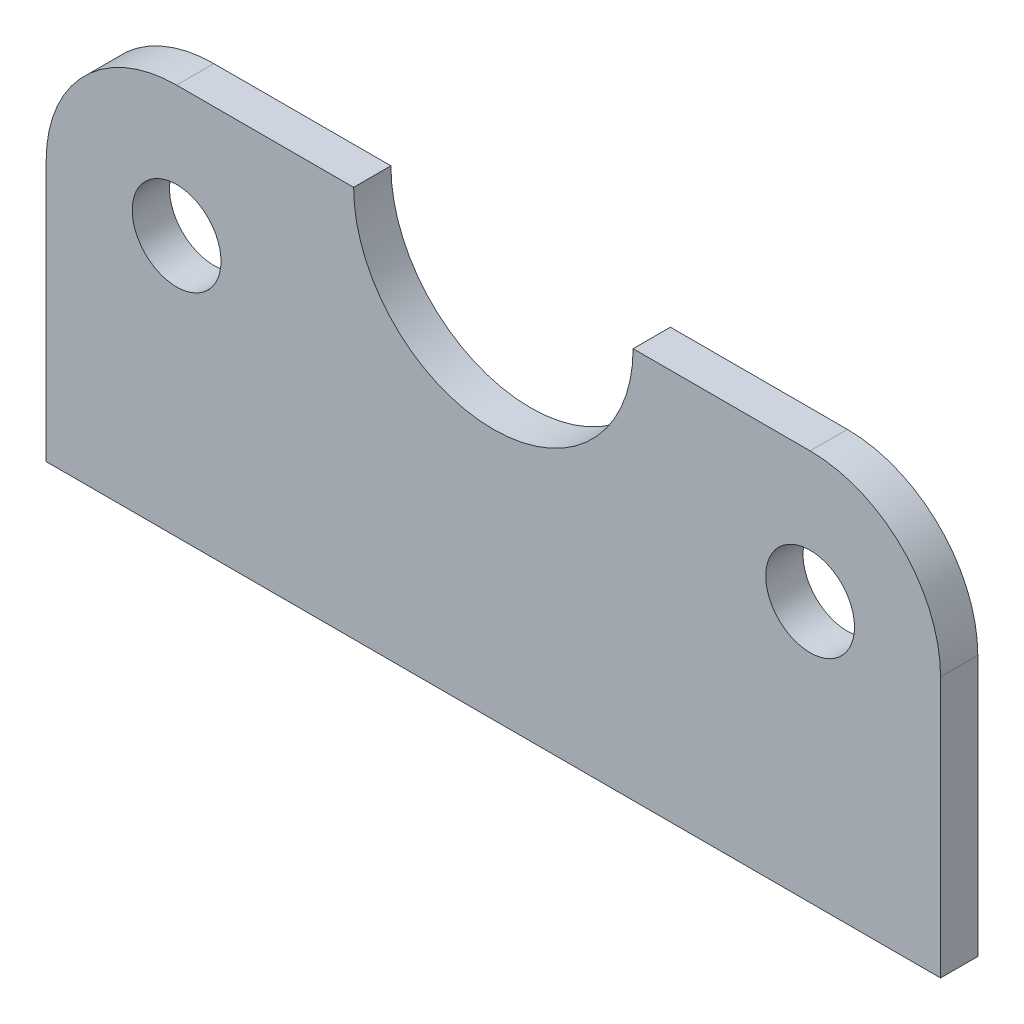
ISO-10303-21;
HEADER;
FILE_DESCRIPTION(('STEP AP214'),'2;1');
FILE_NAME('part.step','',(''),(''),'','','');
FILE_SCHEMA(('AUTOMOTIVE_DESIGN { 1 0 10303 214 1 1 1 1 }'));
ENDSEC;
DATA;
#1=APPLICATION_CONTEXT('core data for automotive mechanical design processes');
#2=APPLICATION_PROTOCOL_DEFINITION('international standard','automotive_design',2000,#1);
#3=PRODUCT_CONTEXT('',#1,'mechanical');
#4=PRODUCT('Part','Part','',(#3));
#5=PRODUCT_RELATED_PRODUCT_CATEGORY('part','',(#4));
#6=PRODUCT_DEFINITION_FORMATION('','',#4);
#7=PRODUCT_DEFINITION_CONTEXT('part definition',#1,'design');
#8=PRODUCT_DEFINITION('design','',#6,#7);
#9=PRODUCT_DEFINITION_SHAPE('','',#8);
#10=(LENGTH_UNIT() NAMED_UNIT(*) SI_UNIT(.MILLI.,.METRE.));
#11=(NAMED_UNIT(*) PLANE_ANGLE_UNIT() SI_UNIT($,.RADIAN.));
#12=(NAMED_UNIT(*) SI_UNIT($,.STERADIAN.) SOLID_ANGLE_UNIT());
#13=UNCERTAINTY_MEASURE_WITH_UNIT(LENGTH_MEASURE(1.E-05),#10,'distance_accuracy_value','');
#14=(GEOMETRIC_REPRESENTATION_CONTEXT(3) GLOBAL_UNCERTAINTY_ASSIGNED_CONTEXT((#13)) GLOBAL_UNIT_ASSIGNED_CONTEXT((#10,
#11,#12)) REPRESENTATION_CONTEXT('',''));
#15=CARTESIAN_POINT('',(0.,0.,0.));
#16=DIRECTION('',(0.,0.,1.));
#17=DIRECTION('',(1.,0.,0.));
#18=AXIS2_PLACEMENT_3D('',#15,#16,#17);
#19=CARTESIAN_POINT('',(-101.6,0.,-4.23333333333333));
#20=DIRECTION('',(0.,-1.,0.));
#21=DIRECTION('',(0.,0.,-1.));
#22=AXIS2_PLACEMENT_3D('',#19,#20,#21);
#23=PLANE('',#22);
#24=DIRECTION('',(1.,0.,0.));
#25=VECTOR('',#24,1.);
#26=CARTESIAN_POINT('',(-101.6,0.,0.));
#27=LINE('',#26,#25);
#28=CARTESIAN_POINT('',(-101.6,0.,0.));
#29=VERTEX_POINT('',#28);
#30=CARTESIAN_POINT('',(0.,0.,0.));
#31=VERTEX_POINT('',#30);
#32=EDGE_CURVE('E129',#29,#31,#27,.T.);
#33=ORIENTED_EDGE('',*,*,#32,.F.);
#34=DIRECTION('',(0.,0.,1.));
#35=VECTOR('',#34,1.);
#36=CARTESIAN_POINT('',(-101.6,0.,-4.23333333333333));
#37=LINE('',#36,#35);
#38=CARTESIAN_POINT('',(-101.6,0.,-4.23333333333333));
#39=VERTEX_POINT('',#38);
#40=EDGE_CURVE('E11',#39,#29,#37,.T.);
#41=ORIENTED_EDGE('',*,*,#40,.F.);
#42=DIRECTION('',(1.,0.,0.));
#43=VECTOR('',#42,1.);
#44=CARTESIAN_POINT('',(-101.6,0.,-4.23333333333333));
#45=LINE('',#44,#43);
#46=CARTESIAN_POINT('',(0.,0.,-4.23333333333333));
#47=VERTEX_POINT('',#46);
#48=EDGE_CURVE('E150',#39,#47,#45,.T.);
#49=ORIENTED_EDGE('',*,*,#48,.T.);
#50=DIRECTION('',(0.,0.,1.));
#51=VECTOR('',#50,1.);
#52=CARTESIAN_POINT('',(0.,0.,-4.23333333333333));
#53=LINE('',#52,#51);
#54=EDGE_CURVE('E35',#47,#31,#53,.T.);
#55=ORIENTED_EDGE('',*,*,#54,.T.);
#56=EDGE_LOOP('',(#33,#41,#49,#55));
#57=FACE_BOUND('',#56,.T.);
#58=ADVANCED_FACE('F32',(#57),#23,.T.);
#59=CARTESIAN_POINT('',(-101.6,29.6333333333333,-4.23333333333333));
#60=DIRECTION('',(-1.,0.,0.));
#61=DIRECTION('',(0.,0.,1.));
#62=AXIS2_PLACEMENT_3D('',#59,#60,#61);
#63=PLANE('',#62);
#64=DIRECTION('',(0.,-1.,0.));
#65=VECTOR('',#64,1.);
#66=CARTESIAN_POINT('',(-101.6,29.6333333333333,0.));
#67=LINE('',#66,#65);
#68=CARTESIAN_POINT('',(-101.6,29.6333333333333,0.));
#69=VERTEX_POINT('',#68);
#70=EDGE_CURVE('E148',#69,#29,#67,.T.);
#71=ORIENTED_EDGE('',*,*,#70,.F.);
#72=DIRECTION('',(0.,0.,1.));
#73=VECTOR('',#72,1.);
#74=CARTESIAN_POINT('',(-101.6,29.6333333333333,-4.23333333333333));
#75=LINE('',#74,#73);
#76=CARTESIAN_POINT('',(-101.6,29.6333333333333,-4.23333333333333));
#77=VERTEX_POINT('',#76);
#78=EDGE_CURVE('E41',#77,#69,#75,.T.);
#79=ORIENTED_EDGE('',*,*,#78,.F.);
#80=DIRECTION('',(0.,-1.,0.));
#81=VECTOR('',#80,1.);
#82=CARTESIAN_POINT('',(-101.6,29.6333333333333,-4.23333333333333));
#83=LINE('',#82,#81);
#84=EDGE_CURVE('E119',#77,#39,#83,.T.);
#85=ORIENTED_EDGE('',*,*,#84,.T.);
#86=ORIENTED_EDGE('',*,*,#40,.T.);
#87=EDGE_LOOP('',(#71,#79,#85,#86));
#88=FACE_BOUND('',#87,.T.);
#89=ADVANCED_FACE('F162',(#88),#63,.T.);
#90=CARTESIAN_POINT('',(-86.7833333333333,29.6333333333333,-4.23333333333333));
#91=DIRECTION('',(0.,0.,1.));
#92=DIRECTION('',(1.,0.,0.));
#93=AXIS2_PLACEMENT_3D('',#90,#91,#92);
#94=CYLINDRICAL_SURFACE('',#93,14.8166666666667);
#95=CARTESIAN_POINT('',(-86.7833333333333,29.6333333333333,0.));
#96=DIRECTION('',(0.,0.,1.));
#97=DIRECTION('',(1.,0.,0.));
#98=AXIS2_PLACEMENT_3D('',#95,#96,#97);
#99=CIRCLE('',#98,14.8166666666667);
#100=CARTESIAN_POINT('',(-86.7833333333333,44.45,0.));
#101=VERTEX_POINT('',#100);
#102=EDGE_CURVE('E106',#101,#69,#99,.T.);
#103=ORIENTED_EDGE('',*,*,#102,.F.);
#104=DIRECTION('',(0.,0.,1.));
#105=VECTOR('',#104,1.);
#106=CARTESIAN_POINT('',(-86.7833333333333,44.45,-4.23333333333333));
#107=LINE('',#106,#105);
#108=CARTESIAN_POINT('',(-86.7833333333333,44.45,-4.23333333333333));
#109=VERTEX_POINT('',#108);
#110=EDGE_CURVE('E101',#109,#101,#107,.T.);
#111=ORIENTED_EDGE('',*,*,#110,.F.);
#112=CARTESIAN_POINT('',(-86.7833333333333,29.6333333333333,-4.23333333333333));
#113=DIRECTION('',(0.,0.,1.));
#114=DIRECTION('',(1.,0.,0.));
#115=AXIS2_PLACEMENT_3D('',#112,#113,#114);
#116=CIRCLE('',#115,14.8166666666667);
#117=EDGE_CURVE('E104',#109,#77,#116,.T.);
#118=ORIENTED_EDGE('',*,*,#117,.T.);
#119=ORIENTED_EDGE('',*,*,#78,.T.);
#120=EDGE_LOOP('',(#103,#111,#118,#119));
#121=FACE_BOUND('',#120,.T.);
#122=ADVANCED_FACE('F103',(#121),#94,.T.);
#123=CARTESIAN_POINT('',(-66.675,44.45,-4.23333333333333));
#124=DIRECTION('',(0.,1.,0.));
#125=DIRECTION('',(0.,0.,1.));
#126=AXIS2_PLACEMENT_3D('',#123,#124,#125);
#127=PLANE('',#126);
#128=DIRECTION('',(-1.,0.,0.));
#129=VECTOR('',#128,1.);
#130=CARTESIAN_POINT('',(-66.675,44.45,0.));
#131=LINE('',#130,#129);
#132=CARTESIAN_POINT('',(-66.675,44.45,0.));
#133=VERTEX_POINT('',#132);
#134=EDGE_CURVE('E145',#133,#101,#131,.T.);
#135=ORIENTED_EDGE('',*,*,#134,.F.);
#136=DIRECTION('',(0.,0.,1.));
#137=VECTOR('',#136,1.);
#138=CARTESIAN_POINT('',(-66.675,44.45,-4.23333333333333));
#139=LINE('',#138,#137);
#140=CARTESIAN_POINT('',(-66.675,44.45,-4.23333333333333));
#141=VERTEX_POINT('',#140);
#142=EDGE_CURVE('E111',#141,#133,#139,.T.);
#143=ORIENTED_EDGE('',*,*,#142,.F.);
#144=DIRECTION('',(-1.,0.,0.));
#145=VECTOR('',#144,1.);
#146=CARTESIAN_POINT('',(-66.675,44.45,-4.23333333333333));
#147=LINE('',#146,#145);
#148=EDGE_CURVE('E117',#141,#109,#147,.T.);
#149=ORIENTED_EDGE('',*,*,#148,.T.);
#150=ORIENTED_EDGE('',*,*,#110,.T.);
#151=EDGE_LOOP('',(#135,#143,#149,#150));
#152=FACE_BOUND('',#151,.T.);
#153=ADVANCED_FACE('F121',(#152),#127,.T.);
#154=CARTESIAN_POINT('',(-50.8,44.45,-4.23333333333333));
#155=DIRECTION('',(0.,0.,1.));
#156=DIRECTION('',(1.,0.,0.));
#157=AXIS2_PLACEMENT_3D('',#154,#155,#156);
#158=CYLINDRICAL_SURFACE('',#157,15.875);
#159=CARTESIAN_POINT('',(-50.8,44.45,0.));
#160=DIRECTION('',(0.,0.,-1.));
#161=DIRECTION('',(1.,0.,0.));
#162=AXIS2_PLACEMENT_3D('',#159,#160,#161);
#163=CIRCLE('',#162,15.875);
#164=CARTESIAN_POINT('',(-34.925,44.45,0.));
#165=VERTEX_POINT('',#164);
#166=EDGE_CURVE('E142',#165,#133,#163,.T.);
#167=ORIENTED_EDGE('',*,*,#166,.F.);
#168=DIRECTION('',(0.,0.,1.));
#169=VECTOR('',#168,1.);
#170=CARTESIAN_POINT('',(-34.925,44.45,-4.23333333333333));
#171=LINE('',#170,#169);
#172=CARTESIAN_POINT('',(-34.925,44.45,-4.23333333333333));
#173=VERTEX_POINT('',#172);
#174=EDGE_CURVE('E154',#173,#165,#171,.T.);
#175=ORIENTED_EDGE('',*,*,#174,.F.);
#176=CARTESIAN_POINT('',(-50.8,44.45,-4.23333333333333));
#177=DIRECTION('',(0.,0.,-1.));
#178=DIRECTION('',(1.,0.,0.));
#179=AXIS2_PLACEMENT_3D('',#176,#177,#178);
#180=CIRCLE('',#179,15.875);
#181=EDGE_CURVE('E122',#173,#141,#180,.T.);
#182=ORIENTED_EDGE('',*,*,#181,.T.);
#183=ORIENTED_EDGE('',*,*,#142,.T.);
#184=EDGE_LOOP('',(#167,#175,#182,#183));
#185=FACE_BOUND('',#184,.T.);
#186=ADVANCED_FACE('F175',(#185),#158,.F.);
#187=CARTESIAN_POINT('',(-14.8166666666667,44.45,-4.23333333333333));
#188=DIRECTION('',(0.,1.,0.));
#189=DIRECTION('',(0.,0.,1.));
#190=AXIS2_PLACEMENT_3D('',#187,#188,#189);
#191=PLANE('',#190);
#192=DIRECTION('',(-1.,0.,0.));
#193=VECTOR('',#192,1.);
#194=CARTESIAN_POINT('',(-14.8166666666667,44.45,0.));
#195=LINE('',#194,#193);
#196=CARTESIAN_POINT('',(-14.8166666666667,44.45,0.));
#197=VERTEX_POINT('',#196);
#198=EDGE_CURVE('E139',#197,#165,#195,.T.);
#199=ORIENTED_EDGE('',*,*,#198,.F.);
#200=DIRECTION('',(0.,0.,1.));
#201=VECTOR('',#200,1.);
#202=CARTESIAN_POINT('',(-14.8166666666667,44.45,-4.23333333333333));
#203=LINE('',#202,#201);
#204=CARTESIAN_POINT('',(-14.8166666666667,44.45,-4.23333333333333));
#205=VERTEX_POINT('',#204);
#206=EDGE_CURVE('E156',#205,#197,#203,.T.);
#207=ORIENTED_EDGE('',*,*,#206,.F.);
#208=DIRECTION('',(-1.,0.,0.));
#209=VECTOR('',#208,1.);
#210=CARTESIAN_POINT('',(-14.8166666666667,44.45,-4.23333333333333));
#211=LINE('',#210,#209);
#212=EDGE_CURVE('E124',#205,#173,#211,.T.);
#213=ORIENTED_EDGE('',*,*,#212,.T.);
#214=ORIENTED_EDGE('',*,*,#174,.T.);
#215=EDGE_LOOP('',(#199,#207,#213,#214));
#216=FACE_BOUND('',#215,.T.);
#217=ADVANCED_FACE('F178',(#216),#191,.T.);
#218=CARTESIAN_POINT('',(-14.8166666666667,29.6333333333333,-4.23333333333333));
#219=DIRECTION('',(0.,0.,1.));
#220=DIRECTION('',(1.,0.,0.));
#221=AXIS2_PLACEMENT_3D('',#218,#219,#220);
#222=CYLINDRICAL_SURFACE('',#221,14.8166666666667);
#223=CARTESIAN_POINT('',(-14.8166666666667,29.6333333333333,0.));
#224=DIRECTION('',(0.,0.,1.));
#225=DIRECTION('',(1.,0.,0.));
#226=AXIS2_PLACEMENT_3D('',#223,#224,#225);
#227=CIRCLE('',#226,14.8166666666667);
#228=CARTESIAN_POINT('',(0.,29.6333333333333,0.));
#229=VERTEX_POINT('',#228);
#230=EDGE_CURVE('E136',#229,#197,#227,.T.);
#231=ORIENTED_EDGE('',*,*,#230,.F.);
#232=DIRECTION('',(0.,0.,1.));
#233=VECTOR('',#232,1.);
#234=CARTESIAN_POINT('',(0.,29.6333333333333,-4.23333333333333));
#235=LINE('',#234,#233);
#236=CARTESIAN_POINT('',(0.,29.6333333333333,-4.23333333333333));
#237=VERTEX_POINT('',#236);
#238=EDGE_CURVE('E157',#237,#229,#235,.T.);
#239=ORIENTED_EDGE('',*,*,#238,.F.);
#240=CARTESIAN_POINT('',(-14.8166666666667,29.6333333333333,-4.23333333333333));
#241=DIRECTION('',(0.,0.,1.));
#242=DIRECTION('',(1.,0.,0.));
#243=AXIS2_PLACEMENT_3D('',#240,#241,#242);
#244=CIRCLE('',#243,14.8166666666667);
#245=EDGE_CURVE('E224',#237,#205,#244,.T.);
#246=ORIENTED_EDGE('',*,*,#245,.T.);
#247=ORIENTED_EDGE('',*,*,#206,.T.);
#248=EDGE_LOOP('',(#231,#239,#246,#247));
#249=FACE_BOUND('',#248,.T.);
#250=ADVANCED_FACE('F182',(#249),#222,.T.);
#251=CARTESIAN_POINT('',(0.,0.,-4.23333333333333));
#252=DIRECTION('',(1.,0.,0.));
#253=DIRECTION('',(0.,0.,-1.));
#254=AXIS2_PLACEMENT_3D('',#251,#252,#253);
#255=PLANE('',#254);
#256=DIRECTION('',(0.,1.,0.));
#257=VECTOR('',#256,1.);
#258=CARTESIAN_POINT('',(0.,0.,0.));
#259=LINE('',#258,#257);
#260=EDGE_CURVE('E132',#31,#229,#259,.T.);
#261=ORIENTED_EDGE('',*,*,#260,.F.);
#262=ORIENTED_EDGE('',*,*,#54,.F.);
#263=DIRECTION('',(0.,1.,0.));
#264=VECTOR('',#263,1.);
#265=CARTESIAN_POINT('',(0.,0.,-4.23333333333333));
#266=LINE('',#265,#264);
#267=EDGE_CURVE('E222',#47,#237,#266,.T.);
#268=ORIENTED_EDGE('',*,*,#267,.T.);
#269=ORIENTED_EDGE('',*,*,#238,.T.);
#270=EDGE_LOOP('',(#261,#262,#268,#269));
#271=FACE_BOUND('',#270,.T.);
#272=ADVANCED_FACE('F159',(#271),#255,.T.);
#273=CARTESIAN_POINT('',(-14.8166666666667,29.6333333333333,-4.23333333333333));
#274=DIRECTION('',(0.,0.,1.));
#275=DIRECTION('',(1.,0.,0.));
#276=AXIS2_PLACEMENT_3D('',#273,#274,#275);
#277=PLANE('',#276);
#278=CARTESIAN_POINT('',(-86.7833333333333,29.6333333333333,-4.23333333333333));
#279=DIRECTION('',(0.,0.,1.));
#280=DIRECTION('',(1.,0.,0.));
#281=AXIS2_PLACEMENT_3D('',#278,#279,#280);
#282=CIRCLE('',#281,5.04189999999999);
#283=CARTESIAN_POINT('',(-81.7414333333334,29.6333333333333,-4.23333333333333));
#284=VERTEX_POINT('',#283);
#285=EDGE_CURVE('E212',#284,#284,#282,.T.);
#286=ORIENTED_EDGE('',*,*,#285,.T.);
#287=EDGE_LOOP('',(#286));
#288=FACE_BOUND('',#287,.T.);
#289=CARTESIAN_POINT('',(-14.8166666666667,29.6333333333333,-4.23333333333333));
#290=DIRECTION('',(0.,0.,1.));
#291=DIRECTION('',(1.,0.,0.));
#292=AXIS2_PLACEMENT_3D('',#289,#290,#291);
#293=CIRCLE('',#292,5.04189999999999);
#294=CARTESIAN_POINT('',(-9.77476666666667,29.6333333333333,-4.23333333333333));
#295=VERTEX_POINT('',#294);
#296=EDGE_CURVE('E133',#295,#295,#293,.T.);
#297=ORIENTED_EDGE('',*,*,#296,.T.);
#298=EDGE_LOOP('',(#297));
#299=FACE_BOUND('',#298,.T.);
#300=ORIENTED_EDGE('',*,*,#48,.F.);
#301=ORIENTED_EDGE('',*,*,#84,.F.);
#302=ORIENTED_EDGE('',*,*,#117,.F.);
#303=ORIENTED_EDGE('',*,*,#148,.F.);
#304=ORIENTED_EDGE('',*,*,#181,.F.);
#305=ORIENTED_EDGE('',*,*,#212,.F.);
#306=ORIENTED_EDGE('',*,*,#245,.F.);
#307=ORIENTED_EDGE('',*,*,#267,.F.);
#308=EDGE_LOOP('',(#300,#301,#302,#303,#304,#305,#306,#307));
#309=FACE_BOUND('',#308,.T.);
#310=ADVANCED_FACE('F115',(#288,#299,#309),#277,.F.);
#311=CARTESIAN_POINT('',(-14.8166666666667,29.6333333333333,0.));
#312=DIRECTION('',(0.,0.,1.));
#313=DIRECTION('',(1.,0.,0.));
#314=AXIS2_PLACEMENT_3D('',#311,#312,#313);
#315=PLANE('',#314);
#316=CARTESIAN_POINT('',(-86.7833333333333,29.6333333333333,0.));
#317=DIRECTION('',(0.,0.,1.));
#318=DIRECTION('',(1.,0.,0.));
#319=AXIS2_PLACEMENT_3D('',#316,#317,#318);
#320=CIRCLE('',#319,5.04189999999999);
#321=CARTESIAN_POINT('',(-81.7414333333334,29.6333333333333,0.));
#322=VERTEX_POINT('',#321);
#323=EDGE_CURVE('E210',#322,#322,#320,.T.);
#324=ORIENTED_EDGE('',*,*,#323,.F.);
#325=EDGE_LOOP('',(#324));
#326=FACE_BOUND('',#325,.T.);
#327=CARTESIAN_POINT('',(-14.8166666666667,29.6333333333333,0.));
#328=DIRECTION('',(0.,0.,1.));
#329=DIRECTION('',(1.,0.,0.));
#330=AXIS2_PLACEMENT_3D('',#327,#328,#329);
#331=CIRCLE('',#330,5.04189999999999);
#332=CARTESIAN_POINT('',(-9.77476666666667,29.6333333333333,0.));
#333=VERTEX_POINT('',#332);
#334=EDGE_CURVE('E213',#333,#333,#331,.T.);
#335=ORIENTED_EDGE('',*,*,#334,.F.);
#336=EDGE_LOOP('',(#335));
#337=FACE_BOUND('',#336,.T.);
#338=ORIENTED_EDGE('',*,*,#32,.T.);
#339=ORIENTED_EDGE('',*,*,#260,.T.);
#340=ORIENTED_EDGE('',*,*,#230,.T.);
#341=ORIENTED_EDGE('',*,*,#198,.T.);
#342=ORIENTED_EDGE('',*,*,#166,.T.);
#343=ORIENTED_EDGE('',*,*,#134,.T.);
#344=ORIENTED_EDGE('',*,*,#102,.T.);
#345=ORIENTED_EDGE('',*,*,#70,.T.);
#346=EDGE_LOOP('',(#338,#339,#340,#341,#342,#343,#344,#345));
#347=FACE_BOUND('',#346,.T.);
#348=ADVANCED_FACE('F161',(#326,#337,#347),#315,.T.);
#349=CARTESIAN_POINT('',(-14.8166666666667,29.6333333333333,0.));
#350=DIRECTION('',(0.,0.,1.));
#351=DIRECTION('',(1.,0.,0.));
#352=AXIS2_PLACEMENT_3D('',#349,#350,#351);
#353=CYLINDRICAL_SURFACE('',#352,5.04189999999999);
#354=ORIENTED_EDGE('',*,*,#334,.T.);
#355=EDGE_LOOP('',(#354));
#356=FACE_BOUND('',#355,.T.);
#357=ORIENTED_EDGE('',*,*,#296,.F.);
#358=EDGE_LOOP('',(#357));
#359=FACE_BOUND('',#358,.T.);
#360=ADVANCED_FACE('F194',(#356,#359),#353,.F.);
#361=CARTESIAN_POINT('',(-86.7833333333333,29.6333333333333,0.));
#362=DIRECTION('',(0.,0.,1.));
#363=DIRECTION('',(1.,0.,0.));
#364=AXIS2_PLACEMENT_3D('',#361,#362,#363);
#365=CYLINDRICAL_SURFACE('',#364,5.04189999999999);
#366=ORIENTED_EDGE('',*,*,#323,.T.);
#367=EDGE_LOOP('',(#366));
#368=FACE_BOUND('',#367,.T.);
#369=ORIENTED_EDGE('',*,*,#285,.F.);
#370=EDGE_LOOP('',(#369));
#371=FACE_BOUND('',#370,.T.);
#372=ADVANCED_FACE('F201',(#368,#371),#365,.F.);
#373=CLOSED_SHELL('',(#58,#89,#122,#153,#186,#217,#250,#272,#310,#348,#360,#372));
#374=MANIFOLD_SOLID_BREP('B2',#373);
#375=ADVANCED_BREP_SHAPE_REPRESENTATION('',(#18,#374),#14);
#376=SHAPE_DEFINITION_REPRESENTATION(#9,#375);
ENDSEC;
END-ISO-10303-21;
